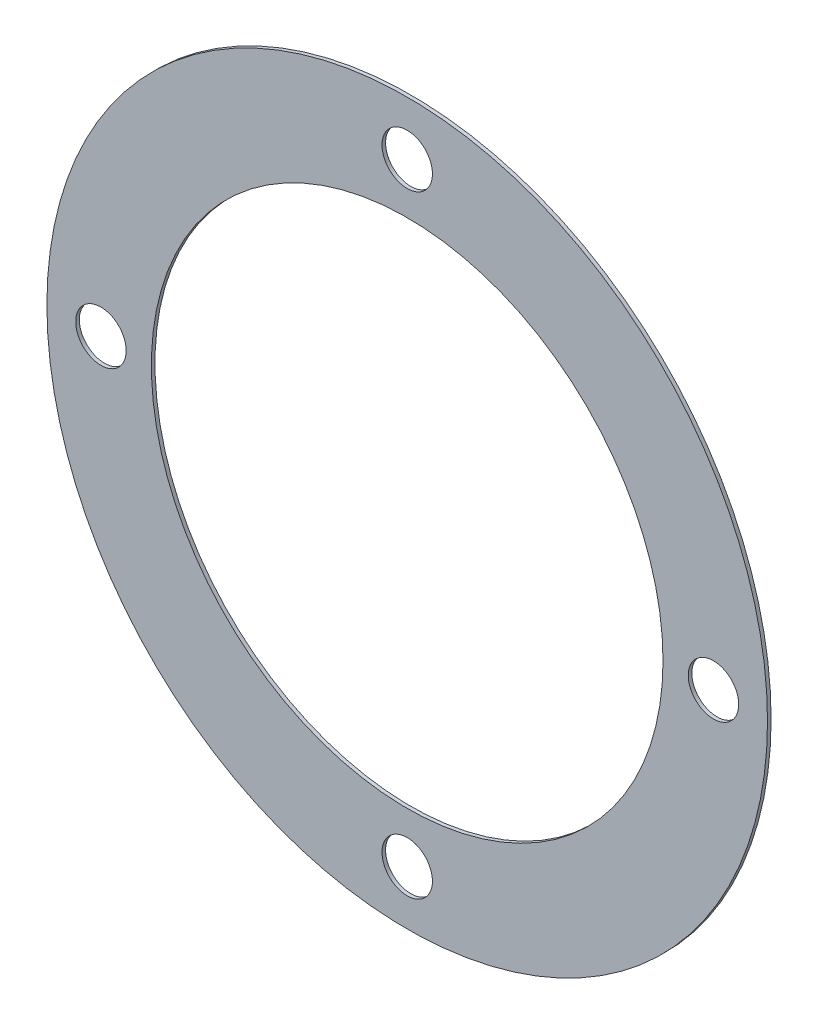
ISO-10303-21;
HEADER;
FILE_DESCRIPTION(('STEP AP214'),'2;1');
FILE_NAME('part.step','',(''),(''),'','','');
FILE_SCHEMA(('AUTOMOTIVE_DESIGN { 1 0 10303 214 1 1 1 1 }'));
ENDSEC;
DATA;
#1=APPLICATION_CONTEXT('core data for automotive mechanical design processes');
#2=APPLICATION_PROTOCOL_DEFINITION('international standard','automotive_design',2000,#1);
#3=PRODUCT_CONTEXT('',#1,'mechanical');
#4=PRODUCT('Part','Part','',(#3));
#5=PRODUCT_RELATED_PRODUCT_CATEGORY('part','',(#4));
#6=PRODUCT_DEFINITION_FORMATION('','',#4);
#7=PRODUCT_DEFINITION_CONTEXT('part definition',#1,'design');
#8=PRODUCT_DEFINITION('design','',#6,#7);
#9=PRODUCT_DEFINITION_SHAPE('','',#8);
#10=(LENGTH_UNIT() NAMED_UNIT(*) SI_UNIT(.MILLI.,.METRE.));
#11=(NAMED_UNIT(*) PLANE_ANGLE_UNIT() SI_UNIT($,.RADIAN.));
#12=(NAMED_UNIT(*) SI_UNIT($,.STERADIAN.) SOLID_ANGLE_UNIT());
#13=UNCERTAINTY_MEASURE_WITH_UNIT(LENGTH_MEASURE(1.E-05),#10,'distance_accuracy_value','');
#14=(GEOMETRIC_REPRESENTATION_CONTEXT(3) GLOBAL_UNCERTAINTY_ASSIGNED_CONTEXT((#13)) GLOBAL_UNIT_ASSIGNED_CONTEXT((#10,
#11,#12)) REPRESENTATION_CONTEXT('',''));
#15=CARTESIAN_POINT('',(0.,0.,0.));
#16=DIRECTION('',(0.,0.,1.));
#17=DIRECTION('',(1.,0.,0.));
#18=AXIS2_PLACEMENT_3D('',#15,#16,#17);
#19=CARTESIAN_POINT('',(0.,0.,0.5));
#20=DIRECTION('',(0.,0.,1.));
#21=DIRECTION('',(1.,0.,0.));
#22=AXIS2_PLACEMENT_3D('',#19,#20,#21);
#23=PLANE('',#22);
#24=CARTESIAN_POINT('',(42.5,4.45164128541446E-13,0.5));
#25=DIRECTION('',(0.,0.,1.));
#26=DIRECTION('',(1.,0.,0.));
#27=AXIS2_PLACEMENT_3D('',#24,#25,#26);
#28=CIRCLE('',#27,3.5);
#29=CARTESIAN_POINT('',(46.,4.45164128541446E-13,0.5));
#30=VERTEX_POINT('',#29);
#31=EDGE_CURVE('E56',#30,#30,#28,.T.);
#32=ORIENTED_EDGE('',*,*,#31,.F.);
#33=EDGE_LOOP('',(#32));
#34=FACE_BOUND('',#33,.T.);
#35=CARTESIAN_POINT('',(-42.5,-1.48388042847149E-13,0.5));
#36=DIRECTION('',(0.,0.,1.));
#37=DIRECTION('',(1.,0.,0.));
#38=AXIS2_PLACEMENT_3D('',#35,#36,#37);
#39=CIRCLE('',#38,3.5);
#40=CARTESIAN_POINT('',(-39.,-1.48388042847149E-13,0.5));
#41=VERTEX_POINT('',#40);
#42=EDGE_CURVE('E44',#41,#41,#39,.T.);
#43=ORIENTED_EDGE('',*,*,#42,.F.);
#44=EDGE_LOOP('',(#43));
#45=FACE_BOUND('',#44,.T.);
#46=CARTESIAN_POINT('',(0.,0.,0.5));
#47=DIRECTION('',(0.,0.,1.));
#48=DIRECTION('',(1.,0.,0.));
#49=AXIS2_PLACEMENT_3D('',#46,#47,#48);
#50=CIRCLE('',#49,50.);
#51=CARTESIAN_POINT('',(50.,0.,0.5));
#52=VERTEX_POINT('',#51);
#53=EDGE_CURVE('E10',#52,#52,#50,.T.);
#54=ORIENTED_EDGE('',*,*,#53,.T.);
#55=EDGE_LOOP('',(#54));
#56=FACE_BOUND('',#55,.T.);
#57=CARTESIAN_POINT('',(2.96776085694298E-13,-42.5,0.5));
#58=DIRECTION('',(0.,0.,1.));
#59=DIRECTION('',(1.,0.,0.));
#60=AXIS2_PLACEMENT_3D('',#57,#58,#59);
#61=CIRCLE('',#60,3.5);
#62=CARTESIAN_POINT('',(3.5000000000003,-42.5,0.5));
#63=VERTEX_POINT('',#62);
#64=EDGE_CURVE('E35',#63,#63,#61,.T.);
#65=ORIENTED_EDGE('',*,*,#64,.F.);
#66=EDGE_LOOP('',(#65));
#67=FACE_BOUND('',#66,.T.);
#68=CARTESIAN_POINT('',(0.,42.5,0.5));
#69=DIRECTION('',(0.,0.,1.));
#70=DIRECTION('',(1.,0.,0.));
#71=AXIS2_PLACEMENT_3D('',#68,#69,#70);
#72=CIRCLE('',#71,3.5);
#73=CARTESIAN_POINT('',(3.5,42.5,0.5));
#74=VERTEX_POINT('',#73);
#75=EDGE_CURVE('E50',#74,#74,#72,.T.);
#76=ORIENTED_EDGE('',*,*,#75,.F.);
#77=EDGE_LOOP('',(#76));
#78=FACE_BOUND('',#77,.T.);
#79=CARTESIAN_POINT('',(0.,0.,0.5));
#80=DIRECTION('',(0.,0.,1.));
#81=DIRECTION('',(1.,0.,0.));
#82=AXIS2_PLACEMENT_3D('',#79,#80,#81);
#83=CIRCLE('',#82,35.5);
#84=CARTESIAN_POINT('',(35.5,0.,0.5));
#85=VERTEX_POINT('',#84);
#86=EDGE_CURVE('E62',#85,#85,#83,.T.);
#87=ORIENTED_EDGE('',*,*,#86,.F.);
#88=EDGE_LOOP('',(#87));
#89=FACE_BOUND('',#88,.T.);
#90=ADVANCED_FACE('F24',(#34,#45,#56,#67,#78,#89),#23,.T.);
#91=CARTESIAN_POINT('',(0.,0.,0.));
#92=DIRECTION('',(0.,0.,1.));
#93=DIRECTION('',(1.,0.,0.));
#94=AXIS2_PLACEMENT_3D('',#91,#92,#93);
#95=PLANE('',#94);
#96=CARTESIAN_POINT('',(42.5,4.45164128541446E-13,0.));
#97=DIRECTION('',(0.,0.,1.));
#98=DIRECTION('',(1.,0.,0.));
#99=AXIS2_PLACEMENT_3D('',#96,#97,#98);
#100=CIRCLE('',#99,3.5);
#101=CARTESIAN_POINT('',(46.,4.45164128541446E-13,0.));
#102=VERTEX_POINT('',#101);
#103=EDGE_CURVE('E59',#102,#102,#100,.T.);
#104=ORIENTED_EDGE('',*,*,#103,.T.);
#105=EDGE_LOOP('',(#104));
#106=FACE_BOUND('',#105,.T.);
#107=CARTESIAN_POINT('',(-42.5,-1.48388042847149E-13,0.));
#108=DIRECTION('',(0.,0.,1.));
#109=DIRECTION('',(1.,0.,0.));
#110=AXIS2_PLACEMENT_3D('',#107,#108,#109);
#111=CIRCLE('',#110,3.5);
#112=CARTESIAN_POINT('',(-39.,-1.48388042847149E-13,0.));
#113=VERTEX_POINT('',#112);
#114=EDGE_CURVE('E47',#113,#113,#111,.T.);
#115=ORIENTED_EDGE('',*,*,#114,.T.);
#116=EDGE_LOOP('',(#115));
#117=FACE_BOUND('',#116,.T.);
#118=CARTESIAN_POINT('',(0.,0.,0.));
#119=DIRECTION('',(0.,0.,1.));
#120=DIRECTION('',(1.,0.,0.));
#121=AXIS2_PLACEMENT_3D('',#118,#119,#120);
#122=CIRCLE('',#121,50.);
#123=CARTESIAN_POINT('',(50.,0.,0.));
#124=VERTEX_POINT('',#123);
#125=EDGE_CURVE('E31',#124,#124,#122,.T.);
#126=ORIENTED_EDGE('',*,*,#125,.F.);
#127=EDGE_LOOP('',(#126));
#128=FACE_BOUND('',#127,.T.);
#129=CARTESIAN_POINT('',(2.96776085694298E-13,-42.5,0.));
#130=DIRECTION('',(0.,0.,1.));
#131=DIRECTION('',(1.,0.,0.));
#132=AXIS2_PLACEMENT_3D('',#129,#130,#131);
#133=CIRCLE('',#132,3.5);
#134=CARTESIAN_POINT('',(3.5000000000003,-42.5,0.));
#135=VERTEX_POINT('',#134);
#136=EDGE_CURVE('E39',#135,#135,#133,.T.);
#137=ORIENTED_EDGE('',*,*,#136,.T.);
#138=EDGE_LOOP('',(#137));
#139=FACE_BOUND('',#138,.T.);
#140=CARTESIAN_POINT('',(0.,42.5,0.));
#141=DIRECTION('',(0.,0.,1.));
#142=DIRECTION('',(1.,0.,0.));
#143=AXIS2_PLACEMENT_3D('',#140,#141,#142);
#144=CIRCLE('',#143,3.5);
#145=CARTESIAN_POINT('',(3.5,42.5,0.));
#146=VERTEX_POINT('',#145);
#147=EDGE_CURVE('E53',#146,#146,#144,.T.);
#148=ORIENTED_EDGE('',*,*,#147,.T.);
#149=EDGE_LOOP('',(#148));
#150=FACE_BOUND('',#149,.T.);
#151=CARTESIAN_POINT('',(0.,0.,0.));
#152=DIRECTION('',(0.,0.,1.));
#153=DIRECTION('',(1.,0.,0.));
#154=AXIS2_PLACEMENT_3D('',#151,#152,#153);
#155=CIRCLE('',#154,35.5);
#156=CARTESIAN_POINT('',(35.5,0.,0.));
#157=VERTEX_POINT('',#156);
#158=EDGE_CURVE('E65',#157,#157,#155,.T.);
#159=ORIENTED_EDGE('',*,*,#158,.T.);
#160=EDGE_LOOP('',(#159));
#161=FACE_BOUND('',#160,.T.);
#162=ADVANCED_FACE('F69',(#106,#117,#128,#139,#150,#161),#95,.F.);
#163=CARTESIAN_POINT('',(0.,0.,0.5));
#164=DIRECTION('',(0.,0.,-1.));
#165=DIRECTION('',(-1.,0.,0.));
#166=AXIS2_PLACEMENT_3D('',#163,#164,#165);
#167=CYLINDRICAL_SURFACE('',#166,50.);
#168=ORIENTED_EDGE('',*,*,#125,.T.);
#169=EDGE_LOOP('',(#168));
#170=FACE_BOUND('',#169,.T.);
#171=ORIENTED_EDGE('',*,*,#53,.F.);
#172=EDGE_LOOP('',(#171));
#173=FACE_BOUND('',#172,.T.);
#174=ADVANCED_FACE('F26',(#170,#173),#167,.T.);
#175=CARTESIAN_POINT('',(2.96776085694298E-13,-42.5,0.5));
#176=DIRECTION('',(0.,0.,-1.));
#177=DIRECTION('',(-1.,0.,0.));
#178=AXIS2_PLACEMENT_3D('',#175,#176,#177);
#179=CYLINDRICAL_SURFACE('',#178,3.5);
#180=ORIENTED_EDGE('',*,*,#64,.T.);
#181=EDGE_LOOP('',(#180));
#182=FACE_BOUND('',#181,.T.);
#183=ORIENTED_EDGE('',*,*,#136,.F.);
#184=EDGE_LOOP('',(#183));
#185=FACE_BOUND('',#184,.T.);
#186=ADVANCED_FACE('F92',(#182,#185),#179,.F.);
#187=CARTESIAN_POINT('',(-42.5,-1.48388042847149E-13,0.5));
#188=DIRECTION('',(0.,0.,-1.));
#189=DIRECTION('',(-1.,0.,0.));
#190=AXIS2_PLACEMENT_3D('',#187,#188,#189);
#191=CYLINDRICAL_SURFACE('',#190,3.5);
#192=ORIENTED_EDGE('',*,*,#42,.T.);
#193=EDGE_LOOP('',(#192));
#194=FACE_BOUND('',#193,.T.);
#195=ORIENTED_EDGE('',*,*,#114,.F.);
#196=EDGE_LOOP('',(#195));
#197=FACE_BOUND('',#196,.T.);
#198=ADVANCED_FACE('F95',(#194,#197),#191,.F.);
#199=CARTESIAN_POINT('',(0.,42.5,0.5));
#200=DIRECTION('',(0.,0.,-1.));
#201=DIRECTION('',(-1.,0.,0.));
#202=AXIS2_PLACEMENT_3D('',#199,#200,#201);
#203=CYLINDRICAL_SURFACE('',#202,3.5);
#204=ORIENTED_EDGE('',*,*,#75,.T.);
#205=EDGE_LOOP('',(#204));
#206=FACE_BOUND('',#205,.T.);
#207=ORIENTED_EDGE('',*,*,#147,.F.);
#208=EDGE_LOOP('',(#207));
#209=FACE_BOUND('',#208,.T.);
#210=ADVANCED_FACE('F79',(#206,#209),#203,.F.);
#211=CARTESIAN_POINT('',(42.5,4.45164128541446E-13,0.5));
#212=DIRECTION('',(0.,0.,-1.));
#213=DIRECTION('',(-1.,0.,0.));
#214=AXIS2_PLACEMENT_3D('',#211,#212,#213);
#215=CYLINDRICAL_SURFACE('',#214,3.5);
#216=ORIENTED_EDGE('',*,*,#31,.T.);
#217=EDGE_LOOP('',(#216));
#218=FACE_BOUND('',#217,.T.);
#219=ORIENTED_EDGE('',*,*,#103,.F.);
#220=EDGE_LOOP('',(#219));
#221=FACE_BOUND('',#220,.T.);
#222=ADVANCED_FACE('F73',(#218,#221),#215,.F.);
#223=CARTESIAN_POINT('',(0.,0.,0.5));
#224=DIRECTION('',(0.,0.,-1.));
#225=DIRECTION('',(-1.,0.,0.));
#226=AXIS2_PLACEMENT_3D('',#223,#224,#225);
#227=CYLINDRICAL_SURFACE('',#226,35.5);
#228=ORIENTED_EDGE('',*,*,#86,.T.);
#229=EDGE_LOOP('',(#228));
#230=FACE_BOUND('',#229,.T.);
#231=ORIENTED_EDGE('',*,*,#158,.F.);
#232=EDGE_LOOP('',(#231));
#233=FACE_BOUND('',#232,.T.);
#234=ADVANCED_FACE('F71',(#230,#233),#227,.F.);
#235=CLOSED_SHELL('',(#90,#162,#174,#186,#198,#210,#222,#234));
#236=MANIFOLD_SOLID_BREP('B2',#235);
#237=ADVANCED_BREP_SHAPE_REPRESENTATION('',(#18,#236),#14);
#238=SHAPE_DEFINITION_REPRESENTATION(#9,#237);
ENDSEC;
END-ISO-10303-21;
